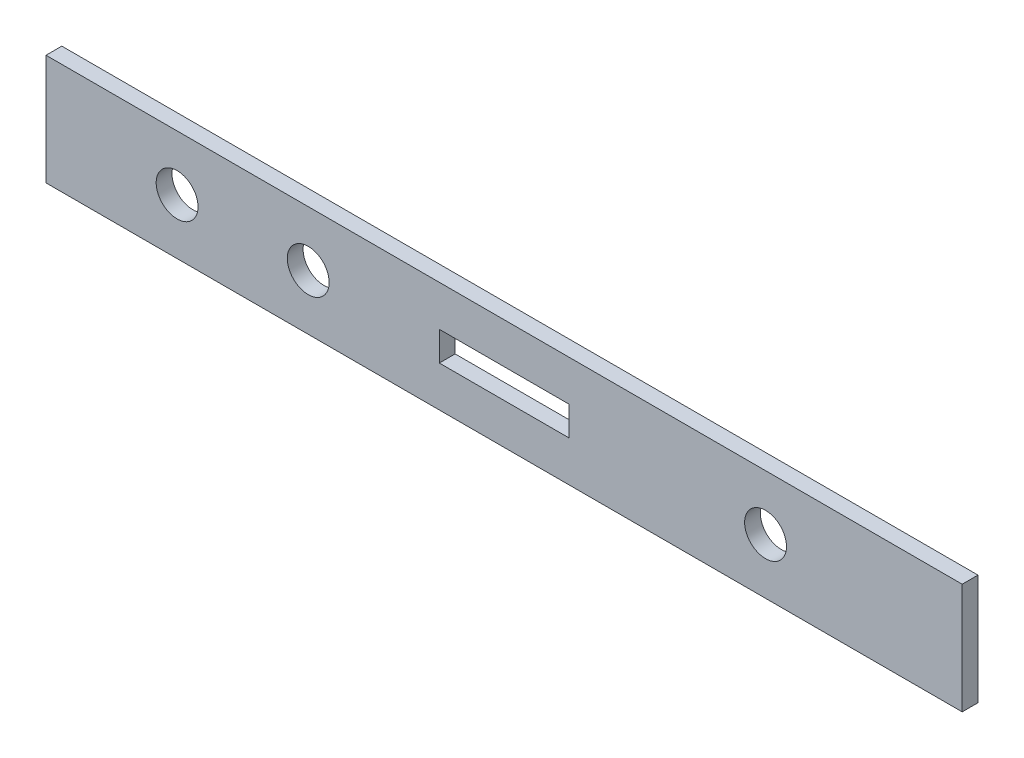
from build123d import *

# Parameters (mm, degrees)
ESQUISSE2_W             = 10
ESQUISSE2_H             = 70
BOSS_EXTRU_1_DEPTH      = 600
ESQUISSE3_W             = 10
ESQUISSE3_H             = 70
ESQUISSE3_H_2           = 73.604573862
ESQUISSE3_W_2           = 82
ESQUISSE3_H_3           = 18.5
ENL_V_MAT_EXTRU_1_DEPTH = 10
ESQUISSE4_R             = 13.25
ENL_V_MAT_EXTRU_2_DEPTH = 10


with BuildPart() as part:
    # Esquisse2 → Boss.-Extru.1 (new body)
    with BuildSketch(Plane(origin=(0, 0, 0), x_dir=(0, 0, -1), z_dir=(1, 0, 0))):
        with Locations((-167.57837648, -158.669438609)):
            Rectangle(ESQUISSE2_W, ESQUISSE2_H)
    extrude(amount=BOSS_EXTRU_1_DEPTH)

    # Esquisse3 → Enl_v. mat.-Extru.1 (cut)
    with BuildSketch(Plane.XY.offset(172.57837648)):
        with Locations((5, -158.669438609)):
            Rectangle(ESQUISSE3_W, ESQUISSE3_H)
        with Locations((595, -156.867151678)):
            Rectangle(ESQUISSE3_W, ESQUISSE3_H_2)
        with Locations((300, -158.669438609)):
            Rectangle(ESQUISSE3_W_2, ESQUISSE3_H_3)
    extrude(amount=-ENL_V_MAT_EXTRU_1_DEPTH, mode=Mode.SUBTRACT)

    # Esquisse4 → Enl_v. mat.-Extru.2 (cut)
    with BuildSketch(Plane.XY.offset(172.57837648)):
        with Locations((93, -158.669438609)):
            Circle(ESQUISSE4_R)
        with Locations((176, -158.669438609)):
            Circle(ESQUISSE4_R)
        with Locations((465.5, -158.669438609)):
            Circle(ESQUISSE4_R)
    extrude(amount=-ENL_V_MAT_EXTRU_2_DEPTH, mode=Mode.SUBTRACT)


solid = part.part
